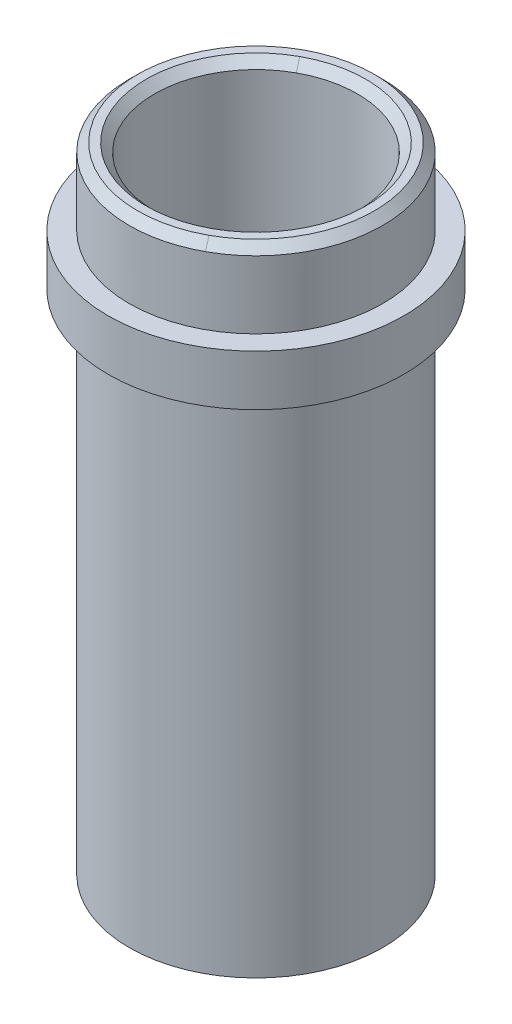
ISO-10303-21;
HEADER;
FILE_DESCRIPTION(('STEP AP214'),'2;1');
FILE_NAME('part.step','',(''),(''),'','','');
FILE_SCHEMA(('AUTOMOTIVE_DESIGN { 1 0 10303 214 1 1 1 1 }'));
ENDSEC;
DATA;
#1=APPLICATION_CONTEXT('core data for automotive mechanical design processes');
#2=APPLICATION_PROTOCOL_DEFINITION('international standard','automotive_design',2000,#1);
#3=PRODUCT_CONTEXT('',#1,'mechanical');
#4=PRODUCT('Part','Part','',(#3));
#5=PRODUCT_RELATED_PRODUCT_CATEGORY('part','',(#4));
#6=PRODUCT_DEFINITION_FORMATION('','',#4);
#7=PRODUCT_DEFINITION_CONTEXT('part definition',#1,'design');
#8=PRODUCT_DEFINITION('design','',#6,#7);
#9=PRODUCT_DEFINITION_SHAPE('','',#8);
#10=(LENGTH_UNIT() NAMED_UNIT(*) SI_UNIT(.MILLI.,.METRE.));
#11=(NAMED_UNIT(*) PLANE_ANGLE_UNIT() SI_UNIT($,.RADIAN.));
#12=(NAMED_UNIT(*) SI_UNIT($,.STERADIAN.) SOLID_ANGLE_UNIT());
#13=UNCERTAINTY_MEASURE_WITH_UNIT(LENGTH_MEASURE(1.E-05),#10,'distance_accuracy_value','');
#14=(GEOMETRIC_REPRESENTATION_CONTEXT(3) GLOBAL_UNCERTAINTY_ASSIGNED_CONTEXT((#13)) GLOBAL_UNIT_ASSIGNED_CONTEXT((#10,
#11,#12)) REPRESENTATION_CONTEXT('',''));
#15=CARTESIAN_POINT('',(0.,0.,0.));
#16=DIRECTION('',(0.,0.,1.));
#17=DIRECTION('',(1.,0.,0.));
#18=AXIS2_PLACEMENT_3D('',#15,#16,#17);
#19=CARTESIAN_POINT('',(0.,-0.999999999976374,0.));
#20=DIRECTION('',(0.,-1.,0.));
#21=DIRECTION('',(0.,0.,-1.));
#22=AXIS2_PLACEMENT_3D('',#19,#20,#21);
#23=CONICAL_SURFACE('',#22,14.9999999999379,0.785398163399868);
#24=DIRECTION('',(-0.339005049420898,0.707106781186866,-0.620544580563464));
#25=VECTOR('',#24,1.);
#26=CARTESIAN_POINT('',(239240.055720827,-499000.,437925.984538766));
#27=LINE('',#26,#25);
#28=CARTESIAN_POINT('',(6.71195754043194,5.21388487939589E-11,12.2861558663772));
#29=VERTEX_POINT('',#28);
#30=CARTESIAN_POINT('',(7.19138307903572,-0.999999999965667,13.1637384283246));
#31=VERTEX_POINT('',#30);
#32=EDGE_CURVE('E57',#29,#31,#27,.F.);
#33=ORIENTED_EDGE('',*,*,#32,.F.);
#34=CARTESIAN_POINT('',(0.,7.41073868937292E-11,0.));
#35=DIRECTION('',(0.,-1.,0.));
#36=DIRECTION('',(0.,0.,-1.));
#37=AXIS2_PLACEMENT_3D('',#34,#35,#36);
#38=CIRCLE('',#37,13.9999999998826);
#39=CARTESIAN_POINT('',(-6.71195758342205,3.70814490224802E-11,-12.2861558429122));
#40=VERTEX_POINT('',#39);
#41=EDGE_CURVE('E20',#40,#29,#38,.F.);
#42=ORIENTED_EDGE('',*,*,#41,.F.);
#43=CARTESIAN_POINT('',(-7.19138307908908,-1.00000000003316,-13.1637384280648));
#44=CARTESIAN_POINT('',(-7.17140701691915,-0.958333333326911,-13.1271724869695));
#45=CARTESIAN_POINT('',(-7.1514309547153,-0.916666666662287,-13.0906065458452));
#46=CARTESIAN_POINT('',(-7.11147883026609,-0.833333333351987,-13.0174746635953));
#47=CARTESIAN_POINT('',(-7.09150276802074,-0.791666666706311,-12.9809087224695));
#48=CARTESIAN_POINT('',(-7.05155064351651,-0.708333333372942,-12.9077768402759));
#49=CARTESIAN_POINT('',(-7.03157458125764,-0.666666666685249,-12.871210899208));
#50=CARTESIAN_POINT('',(-6.99162245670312,-0.583333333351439,-12.7980790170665));
#51=CARTESIAN_POINT('',(-6.97164639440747,-0.541666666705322,-12.7615130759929));
#52=CARTESIAN_POINT('',(-6.9316942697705,-0.458333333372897,-12.6883811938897));
#53=CARTESIAN_POINT('',(-6.91171820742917,-0.41666666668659,-12.6518152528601));
#54=CARTESIAN_POINT('',(-6.87176608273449,-0.333333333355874,-12.5786833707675));
#55=CARTESIAN_POINT('',(-6.85179002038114,-0.291666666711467,-12.5421174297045));
#56=CARTESIAN_POINT('',(-6.81183789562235,-0.208333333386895,-12.4689855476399));
#57=CARTESIAN_POINT('',(-6.79186183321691,-0.166666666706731,-12.4324196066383));
#58=CARTESIAN_POINT('',(-6.75190970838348,-0.083333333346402,-12.3592877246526));
#59=CARTESIAN_POINT('',(-6.73193364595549,-0.0416666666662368,-12.3227217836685));
#60=CARTESIAN_POINT('',(-6.71195758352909,0.,-12.2861558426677));
#61=B_SPLINE_CURVE_WITH_KNOTS('',3,(#43,#44,#45,#46,#47,#48,#49,#50,#51,#52,#53,#54,#55,#56,#57,
#58,#59,#60),.UNSPECIFIED.,.F.,.F.,(4,2,2,2,2,2,2,2,4),(0.,0.176776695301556,0.353553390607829,
0.530330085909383,0.707106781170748,0.883883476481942,1.06066017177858,1.23743686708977,
1.41421356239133),.UNSPECIFIED.);
#62=CARTESIAN_POINT('',(-7.1913830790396,-1.00000000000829,-13.1637384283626));
#63=VERTEX_POINT('',#62);
#64=EDGE_CURVE('E64',#63,#40,#61,.T.);
#65=ORIENTED_EDGE('',*,*,#64,.F.);
#66=CARTESIAN_POINT('',(0.,-1.,0.));
#67=DIRECTION('',(0.,1.,0.));
#68=DIRECTION('',(0.,0.,1.));
#69=AXIS2_PLACEMENT_3D('',#66,#67,#68);
#70=CIRCLE('',#69,15.);
#71=EDGE_CURVE('E60',#31,#63,#70,.F.);
#72=ORIENTED_EDGE('',*,*,#71,.F.);
#73=EDGE_LOOP('',(#33,#42,#65,#72));
#74=FACE_BOUND('',#73,.T.);
#75=ADVANCED_FACE('F16',(#74),#23,.T.);
#76=CARTESIAN_POINT('',(0.,-0.999999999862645,0.));
#77=DIRECTION('',(0.,-1.,0.));
#78=DIRECTION('',(1.,0.,0.));
#79=AXIS2_PLACEMENT_3D('',#76,#77,#78);
#80=CONICAL_SURFACE('',#79,14.9999999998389,0.785398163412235);
#81=ORIENTED_EDGE('',*,*,#64,.T.);
#82=CARTESIAN_POINT('',(0.,-2.66522914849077E-11,0.));
#83=DIRECTION('',(0.,-1.,0.));
#84=DIRECTION('',(1.,0.,0.));
#85=AXIS2_PLACEMENT_3D('',#82,#83,#84);
#86=CIRCLE('',#85,13.9999999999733);
#87=EDGE_CURVE('E67',#29,#40,#86,.F.);
#88=ORIENTED_EDGE('',*,*,#87,.F.);
#89=ORIENTED_EDGE('',*,*,#32,.T.);
#90=CARTESIAN_POINT('',(0.,-1.,0.));
#91=DIRECTION('',(0.,1.,0.));
#92=DIRECTION('',(0.,0.,1.));
#93=AXIS2_PLACEMENT_3D('',#90,#91,#92);
#94=CIRCLE('',#93,15.);
#95=EDGE_CURVE('E72',#63,#31,#94,.F.);
#96=ORIENTED_EDGE('',*,*,#95,.F.);
#97=EDGE_LOOP('',(#81,#88,#89,#96));
#98=FACE_BOUND('',#97,.T.);
#99=ADVANCED_FACE('F68',(#98),#80,.T.);
#100=CARTESIAN_POINT('',(0.,-37.5,0.));
#101=DIRECTION('',(0.,1.,0.));
#102=DIRECTION('',(0.,0.,1.));
#103=AXIS2_PLACEMENT_3D('',#100,#101,#102);
#104=CYLINDRICAL_SURFACE('',#103,15.);
#105=CARTESIAN_POINT('',(0.,-9.,0.));
#106=DIRECTION('',(0.,1.,0.));
#107=DIRECTION('',(0.,0.,1.));
#108=AXIS2_PLACEMENT_3D('',#105,#106,#107);
#109=CIRCLE('',#108,15.);
#110=CARTESIAN_POINT('',(0.,-9.,15.));
#111=VERTEX_POINT('',#110);
#112=EDGE_CURVE('E70',#111,#111,#109,.F.);
#113=ORIENTED_EDGE('',*,*,#112,.F.);
#114=EDGE_LOOP('',(#113));
#115=FACE_BOUND('',#114,.T.);
#116=ORIENTED_EDGE('',*,*,#71,.T.);
#117=ORIENTED_EDGE('',*,*,#95,.T.);
#118=EDGE_LOOP('',(#116,#117));
#119=FACE_BOUND('',#118,.T.);
#120=ADVANCED_FACE('F105',(#115,#119),#104,.T.);
#121=CARTESIAN_POINT('',(0.,0.,15.));
#122=DIRECTION('',(0.,1.,0.));
#123=DIRECTION('',(0.,0.,1.));
#124=AXIS2_PLACEMENT_3D('',#121,#122,#123);
#125=PLANE('',#124);
#126=CARTESIAN_POINT('',(0.,-5.68642355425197E-11,0.));
#127=DIRECTION('',(0.,1.,0.));
#128=DIRECTION('',(-1.,0.,0.));
#129=AXIS2_PLACEMENT_3D('',#126,#127,#128);
#130=CIRCLE('',#129,12.9999999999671);
#131=CARTESIAN_POINT('',(-6.23253189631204,0.,-11.4085733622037));
#132=VERTEX_POINT('',#131);
#133=CARTESIAN_POINT('',(6.23253200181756,-2.84286483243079E-11,11.4085733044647));
#134=VERTEX_POINT('',#133);
#135=EDGE_CURVE('E97',#132,#134,#130,.F.);
#136=ORIENTED_EDGE('',*,*,#135,.T.);
#137=CARTESIAN_POINT('',(0.,5.68711744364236E-11,0.));
#138=DIRECTION('',(0.,1.,0.));
#139=DIRECTION('',(0.,0.,1.));
#140=AXIS2_PLACEMENT_3D('',#137,#138,#139);
#141=CIRCLE('',#140,12.9999999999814);
#142=EDGE_CURVE('E94',#134,#132,#141,.F.);
#143=ORIENTED_EDGE('',*,*,#142,.T.);
#144=EDGE_LOOP('',(#136,#143));
#145=FACE_BOUND('',#144,.T.);
#146=ORIENTED_EDGE('',*,*,#41,.T.);
#147=ORIENTED_EDGE('',*,*,#87,.T.);
#148=EDGE_LOOP('',(#146,#147));
#149=FACE_BOUND('',#148,.T.);
#150=ADVANCED_FACE('F71',(#145,#149),#125,.T.);
#151=CARTESIAN_POINT('',(0.,-9.,15.));
#152=DIRECTION('',(0.,1.,0.));
#153=DIRECTION('',(0.,0.,1.));
#154=AXIS2_PLACEMENT_3D('',#151,#152,#153);
#155=PLANE('',#154);
#156=ORIENTED_EDGE('',*,*,#112,.T.);
#157=EDGE_LOOP('',(#156));
#158=FACE_BOUND('',#157,.T.);
#159=CARTESIAN_POINT('',(0.,-9.,0.));
#160=DIRECTION('',(0.,1.,0.));
#161=DIRECTION('',(0.,0.,1.));
#162=AXIS2_PLACEMENT_3D('',#159,#160,#161);
#163=CIRCLE('',#162,17.5);
#164=CARTESIAN_POINT('',(0.,-9.,17.5));
#165=VERTEX_POINT('',#164);
#166=EDGE_CURVE('E90',#165,#165,#163,.F.);
#167=ORIENTED_EDGE('',*,*,#166,.F.);
#168=EDGE_LOOP('',(#167));
#169=FACE_BOUND('',#168,.T.);
#170=ADVANCED_FACE('F102',(#158,#169),#155,.T.);
#171=CARTESIAN_POINT('',(0.,-5.68642355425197E-11,0.));
#172=DIRECTION('',(0.,1.,0.));
#173=DIRECTION('',(-1.,0.,0.));
#174=AXIS2_PLACEMENT_3D('',#171,#172,#173);
#175=CONICAL_SURFACE('',#174,12.9999999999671,0.785398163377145);
#176=ORIENTED_EDGE('',*,*,#135,.F.);
#177=CARTESIAN_POINT('',(-6.23253189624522,0.,-11.4085733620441));
#178=CARTESIAN_POINT('',(-6.21255583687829,-0.0416666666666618,-11.3720074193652));
#179=CARTESIAN_POINT('',(-6.19257977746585,-0.0833333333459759,-11.3354414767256));
#180=CARTESIAN_POINT('',(-6.15262765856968,-0.166666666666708,-11.2623095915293));
#181=CARTESIAN_POINT('',(-6.13265159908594,-0.208333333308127,-11.2257436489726));
#182=CARTESIAN_POINT('',(-6.09269947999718,-0.291666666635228,-11.1526117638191));
#183=CARTESIAN_POINT('',(-6.07272342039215,-0.33333333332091,-11.1160458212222));
#184=CARTESIAN_POINT('',(-6.0327713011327,-0.416666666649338,-11.0429139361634));
#185=CARTESIAN_POINT('',(-6.01279524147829,-0.458333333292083,-11.0063479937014));
#186=CARTESIAN_POINT('',(-5.97284312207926,-0.541666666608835,-10.9332161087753));
#187=CARTESIAN_POINT('',(-5.95286706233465,-0.583333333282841,-10.8966501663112));
#188=CARTESIAN_POINT('',(-5.91291494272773,-0.666666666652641,-10.823518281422));
#189=CARTESIAN_POINT('',(-5.89293888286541,-0.708333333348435,-10.7869523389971));
#190=CARTESIAN_POINT('',(-5.85298676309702,-0.791666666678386,-10.7138204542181));
#191=CARTESIAN_POINT('',(-5.83301070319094,-0.833333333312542,-10.677254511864));
#192=CARTESIAN_POINT('',(-5.79305858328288,-0.916666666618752,-10.604122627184));
#193=CARTESIAN_POINT('',(-5.77308252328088,-0.958333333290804,-10.5675566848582));
#194=CARTESIAN_POINT('',(-5.75310646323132,-0.999999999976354,-10.5309907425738));
#195=B_SPLINE_CURVE_WITH_KNOTS('',3,(#177,#178,#179,#180,#181,#182,#183,#184,#185,#186,#187,
#188,#189,#190,#191,#192,#193,#194),.UNSPECIFIED.,.F.,.F.,(4,2,2,2,2,2,2,2,4),(0.,
0.176776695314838,0.353553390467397,0.530330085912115,0.707106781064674,0.883883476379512,
1.06066017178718,1.23743686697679,1.41421356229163),.UNSPECIFIED.);
#196=CARTESIAN_POINT('',(-5.75310646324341,-0.999999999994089,-10.5309907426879));
#197=VERTEX_POINT('',#196);
#198=EDGE_CURVE('E93',#132,#197,#195,.T.);
#199=ORIENTED_EDGE('',*,*,#198,.T.);
#200=CARTESIAN_POINT('',(0.,-1.,0.));
#201=DIRECTION('',(0.,1.,0.));
#202=DIRECTION('',(0.,0.,1.));
#203=AXIS2_PLACEMENT_3D('',#200,#201,#202);
#204=CIRCLE('',#203,12.);
#205=CARTESIAN_POINT('',(5.75310646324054,-0.999999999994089,10.5309907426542));
#206=VERTEX_POINT('',#205);
#207=EDGE_CURVE('E35',#197,#206,#204,.F.);
#208=ORIENTED_EDGE('',*,*,#207,.T.);
#209=DIRECTION('',(-0.339005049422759,-0.707106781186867,-0.620544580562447));
#210=VECTOR('',#209,1.);
#211=CARTESIAN_POINT('',(239239.576296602,499000.000000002,437925.106955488));
#212=LINE('',#211,#210);
#213=EDGE_CURVE('E96',#206,#134,#212,.F.);
#214=ORIENTED_EDGE('',*,*,#213,.T.);
#215=EDGE_LOOP('',(#176,#199,#208,#214));
#216=FACE_BOUND('',#215,.T.);
#217=ADVANCED_FACE('F141',(#216),#175,.F.);
#218=CARTESIAN_POINT('',(0.,5.68711744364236E-11,0.));
#219=DIRECTION('',(0.,1.,0.));
#220=DIRECTION('',(0.,0.,1.));
#221=AXIS2_PLACEMENT_3D('',#218,#219,#220);
#222=CONICAL_SURFACE('',#221,12.9999999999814,0.785398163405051);
#223=ORIENTED_EDGE('',*,*,#142,.F.);
#224=ORIENTED_EDGE('',*,*,#213,.F.);
#225=CARTESIAN_POINT('',(0.,-1.,0.));
#226=DIRECTION('',(0.,1.,0.));
#227=DIRECTION('',(0.,0.,1.));
#228=AXIS2_PLACEMENT_3D('',#225,#226,#227);
#229=CIRCLE('',#228,12.);
#230=EDGE_CURVE('E89',#206,#197,#229,.F.);
#231=ORIENTED_EDGE('',*,*,#230,.T.);
#232=ORIENTED_EDGE('',*,*,#198,.F.);
#233=EDGE_LOOP('',(#223,#224,#231,#232));
#234=FACE_BOUND('',#233,.T.);
#235=ADVANCED_FACE('F137',(#234),#222,.F.);
#236=CARTESIAN_POINT('',(0.,-37.5,0.));
#237=DIRECTION('',(0.,1.,0.));
#238=DIRECTION('',(0.,0.,1.));
#239=AXIS2_PLACEMENT_3D('',#236,#237,#238);
#240=CYLINDRICAL_SURFACE('',#239,17.5);
#241=CARTESIAN_POINT('',(0.,-15.,0.));
#242=DIRECTION('',(0.,1.,0.));
#243=DIRECTION('',(0.,0.,1.));
#244=AXIS2_PLACEMENT_3D('',#241,#242,#243);
#245=CIRCLE('',#244,17.5);
#246=CARTESIAN_POINT('',(0.,-15.,17.5));
#247=VERTEX_POINT('',#246);
#248=EDGE_CURVE('E86',#247,#247,#245,.T.);
#249=ORIENTED_EDGE('',*,*,#248,.T.);
#250=EDGE_LOOP('',(#249));
#251=FACE_BOUND('',#250,.T.);
#252=ORIENTED_EDGE('',*,*,#166,.T.);
#253=EDGE_LOOP('',(#252));
#254=FACE_BOUND('',#253,.T.);
#255=ADVANCED_FACE('F134',(#251,#254),#240,.T.);
#256=CARTESIAN_POINT('',(0.,-37.5,0.));
#257=DIRECTION('',(0.,1.,0.));
#258=DIRECTION('',(0.,0.,1.));
#259=AXIS2_PLACEMENT_3D('',#256,#257,#258);
#260=CYLINDRICAL_SURFACE('',#259,12.);
#261=CARTESIAN_POINT('',(0.,-75.,0.));
#262=DIRECTION('',(0.,1.,0.));
#263=DIRECTION('',(0.,0.,1.));
#264=AXIS2_PLACEMENT_3D('',#261,#262,#263);
#265=CIRCLE('',#264,12.);
#266=CARTESIAN_POINT('',(0.,-75.,12.));
#267=VERTEX_POINT('',#266);
#268=EDGE_CURVE('E83',#267,#267,#265,.F.);
#269=ORIENTED_EDGE('',*,*,#268,.T.);
#270=EDGE_LOOP('',(#269));
#271=FACE_BOUND('',#270,.T.);
#272=ORIENTED_EDGE('',*,*,#230,.F.);
#273=ORIENTED_EDGE('',*,*,#207,.F.);
#274=EDGE_LOOP('',(#272,#273));
#275=FACE_BOUND('',#274,.T.);
#276=ADVANCED_FACE('F130',(#271,#275),#260,.F.);
#277=CARTESIAN_POINT('',(0.,-15.,17.5));
#278=DIRECTION('',(0.,1.,0.));
#279=DIRECTION('',(0.,0.,1.));
#280=AXIS2_PLACEMENT_3D('',#277,#278,#279);
#281=PLANE('',#280);
#282=CARTESIAN_POINT('',(0.,-15.,0.));
#283=DIRECTION('',(0.,1.,0.));
#284=DIRECTION('',(0.,0.,1.));
#285=AXIS2_PLACEMENT_3D('',#282,#283,#284);
#286=CIRCLE('',#285,15.);
#287=CARTESIAN_POINT('',(0.,-15.,15.));
#288=VERTEX_POINT('',#287);
#289=EDGE_CURVE('E26',#288,#288,#286,.F.);
#290=ORIENTED_EDGE('',*,*,#289,.F.);
#291=EDGE_LOOP('',(#290));
#292=FACE_BOUND('',#291,.T.);
#293=ORIENTED_EDGE('',*,*,#248,.F.);
#294=EDGE_LOOP('',(#293));
#295=FACE_BOUND('',#294,.T.);
#296=ADVANCED_FACE('F122',(#292,#295),#281,.F.);
#297=CARTESIAN_POINT('',(0.,-75.,15.));
#298=DIRECTION('',(0.,1.,0.));
#299=DIRECTION('',(0.,0.,1.));
#300=AXIS2_PLACEMENT_3D('',#297,#298,#299);
#301=PLANE('',#300);
#302=ORIENTED_EDGE('',*,*,#268,.F.);
#303=EDGE_LOOP('',(#302));
#304=FACE_BOUND('',#303,.T.);
#305=CARTESIAN_POINT('',(0.,-75.,0.));
#306=DIRECTION('',(0.,1.,0.));
#307=DIRECTION('',(0.,0.,1.));
#308=AXIS2_PLACEMENT_3D('',#305,#306,#307);
#309=CIRCLE('',#308,15.);
#310=CARTESIAN_POINT('',(0.,-75.,15.));
#311=VERTEX_POINT('',#310);
#312=EDGE_CURVE('E11',#311,#311,#309,.T.);
#313=ORIENTED_EDGE('',*,*,#312,.F.);
#314=EDGE_LOOP('',(#313));
#315=FACE_BOUND('',#314,.T.);
#316=ADVANCED_FACE('F117',(#304,#315),#301,.F.);
#317=CARTESIAN_POINT('',(0.,-37.5,0.));
#318=DIRECTION('',(0.,1.,0.));
#319=DIRECTION('',(0.,0.,1.));
#320=AXIS2_PLACEMENT_3D('',#317,#318,#319);
#321=CYLINDRICAL_SURFACE('',#320,15.);
#322=ORIENTED_EDGE('',*,*,#312,.T.);
#323=EDGE_LOOP('',(#322));
#324=FACE_BOUND('',#323,.T.);
#325=ORIENTED_EDGE('',*,*,#289,.T.);
#326=EDGE_LOOP('',(#325));
#327=FACE_BOUND('',#326,.T.);
#328=ADVANCED_FACE('F18',(#324,#327),#321,.T.);
#329=CLOSED_SHELL('',(#75,#99,#120,#150,#170,#217,#235,#255,#276,#296,#316,#328));
#330=MANIFOLD_SOLID_BREP('B1',#329);
#331=ADVANCED_BREP_SHAPE_REPRESENTATION('',(#18,#330),#14);
#332=SHAPE_DEFINITION_REPRESENTATION(#9,#331);
ENDSEC;
END-ISO-10303-21;
